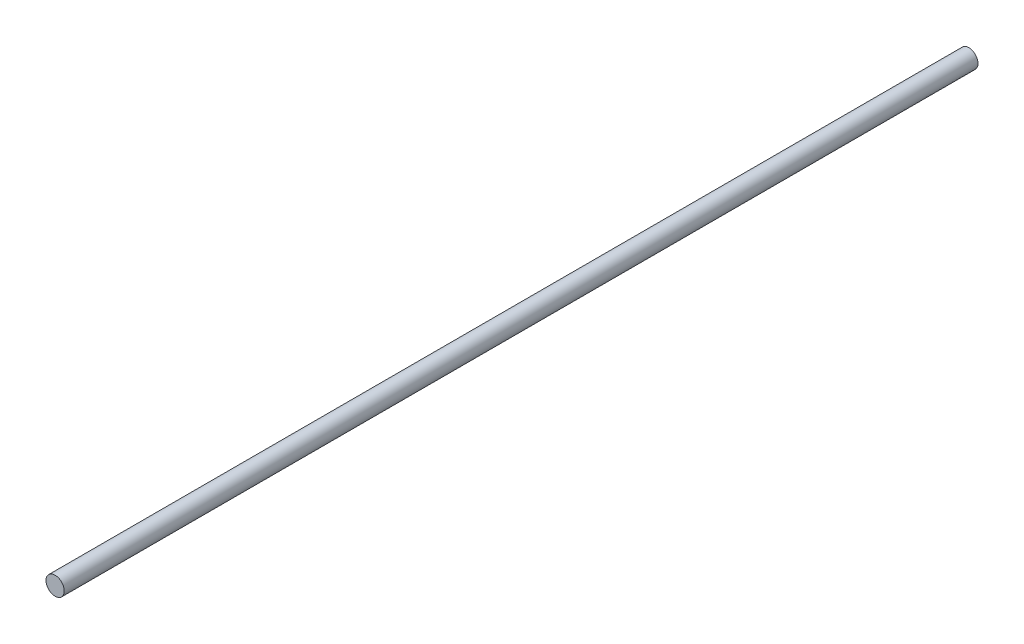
ISO-10303-21;
HEADER;
FILE_DESCRIPTION(('STEP AP214'),'2;1');
FILE_NAME('part.step','',(''),(''),'','','');
FILE_SCHEMA(('AUTOMOTIVE_DESIGN { 1 0 10303 214 1 1 1 1 }'));
ENDSEC;
DATA;
#1=APPLICATION_CONTEXT('core data for automotive mechanical design processes');
#2=APPLICATION_PROTOCOL_DEFINITION('international standard','automotive_design',2000,#1);
#3=PRODUCT_CONTEXT('',#1,'mechanical');
#4=PRODUCT('Part','Part','',(#3));
#5=PRODUCT_RELATED_PRODUCT_CATEGORY('part','',(#4));
#6=PRODUCT_DEFINITION_FORMATION('','',#4);
#7=PRODUCT_DEFINITION_CONTEXT('part definition',#1,'design');
#8=PRODUCT_DEFINITION('design','',#6,#7);
#9=PRODUCT_DEFINITION_SHAPE('','',#8);
#10=(LENGTH_UNIT() NAMED_UNIT(*) SI_UNIT(.MILLI.,.METRE.));
#11=(NAMED_UNIT(*) PLANE_ANGLE_UNIT() SI_UNIT($,.RADIAN.));
#12=(NAMED_UNIT(*) SI_UNIT($,.STERADIAN.) SOLID_ANGLE_UNIT());
#13=UNCERTAINTY_MEASURE_WITH_UNIT(LENGTH_MEASURE(1.E-05),#10,'distance_accuracy_value','');
#14=(GEOMETRIC_REPRESENTATION_CONTEXT(3) GLOBAL_UNCERTAINTY_ASSIGNED_CONTEXT((#13)) GLOBAL_UNIT_ASSIGNED_CONTEXT((#10,
#11,#12)) REPRESENTATION_CONTEXT('',''));
#15=CARTESIAN_POINT('',(0.,0.,0.));
#16=DIRECTION('',(0.,0.,1.));
#17=DIRECTION('',(1.,0.,0.));
#18=AXIS2_PLACEMENT_3D('',#15,#16,#17);
#19=CARTESIAN_POINT('',(0.,0.,-3000.));
#20=DIRECTION('',(0.,0.,1.));
#21=DIRECTION('',(1.,0.,0.));
#22=AXIS2_PLACEMENT_3D('',#19,#20,#21);
#23=CYLINDRICAL_SURFACE('',#22,30.);
#24=CARTESIAN_POINT('',(0.,0.,-3000.));
#25=DIRECTION('',(0.,0.,1.));
#26=DIRECTION('',(1.,0.,0.));
#27=AXIS2_PLACEMENT_3D('',#24,#25,#26);
#28=CIRCLE('',#27,30.);
#29=CARTESIAN_POINT('',(30.,0.,-3000.));
#30=VERTEX_POINT('',#29);
#31=EDGE_CURVE('E10',#30,#30,#28,.T.);
#32=ORIENTED_EDGE('',*,*,#31,.T.);
#33=EDGE_LOOP('',(#32));
#34=FACE_BOUND('',#33,.T.);
#35=CARTESIAN_POINT('',(0.,0.,0.));
#36=DIRECTION('',(0.,0.,1.));
#37=DIRECTION('',(1.,0.,0.));
#38=AXIS2_PLACEMENT_3D('',#35,#36,#37);
#39=CIRCLE('',#38,30.);
#40=CARTESIAN_POINT('',(30.,0.,0.));
#41=VERTEX_POINT('',#40);
#42=EDGE_CURVE('E35',#41,#41,#39,.T.);
#43=ORIENTED_EDGE('',*,*,#42,.F.);
#44=EDGE_LOOP('',(#43));
#45=FACE_BOUND('',#44,.T.);
#46=ADVANCED_FACE('F32',(#34,#45),#23,.T.);
#47=CARTESIAN_POINT('',(0.,0.,-3000.));
#48=DIRECTION('',(0.,0.,1.));
#49=DIRECTION('',(1.,0.,0.));
#50=AXIS2_PLACEMENT_3D('',#47,#48,#49);
#51=PLANE('',#50);
#52=ORIENTED_EDGE('',*,*,#31,.F.);
#53=EDGE_LOOP('',(#52));
#54=FACE_BOUND('',#53,.T.);
#55=ADVANCED_FACE('F47',(#54),#51,.F.);
#56=CARTESIAN_POINT('',(0.,0.,0.));
#57=DIRECTION('',(0.,0.,1.));
#58=DIRECTION('',(1.,0.,0.));
#59=AXIS2_PLACEMENT_3D('',#56,#57,#58);
#60=PLANE('',#59);
#61=ORIENTED_EDGE('',*,*,#42,.T.);
#62=EDGE_LOOP('',(#61));
#63=FACE_BOUND('',#62,.T.);
#64=ADVANCED_FACE('F44',(#63),#60,.T.);
#65=CLOSED_SHELL('',(#46,#55,#64));
#66=MANIFOLD_SOLID_BREP('B2',#65);
#67=ADVANCED_BREP_SHAPE_REPRESENTATION('',(#18,#66),#14);
#68=SHAPE_DEFINITION_REPRESENTATION(#9,#67);
ENDSEC;
END-ISO-10303-21;
